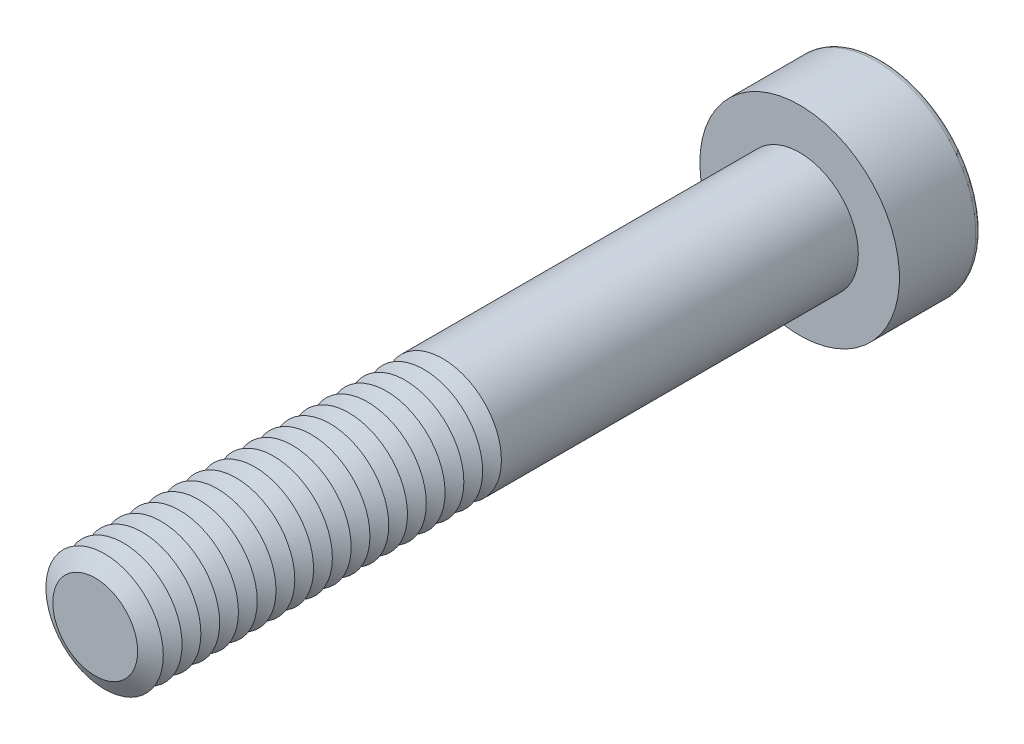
from build123d import *

# Parameters (mm, degrees)
SKETCH1_R           = 2.5
BOSS_EXTRUDE1_DEPTH = 30
SKETCH2_R           = 4.25
BOSS_EXTRUDE2_DEPTH = 3.5
CUT_EXTRUDE1_DEPTH  = 2.25
FILLET1_R           = 0.25
LPATTERN1_COUNT     = 19
LPATTERN1_PITCH     = 0.8


with BuildPart() as part:
    # Sketch1 → Boss-Extrude1 (new body)
    with BuildSketch(Plane.XY):
        Circle(SKETCH1_R)
    extrude(amount=BOSS_EXTRUDE1_DEPTH)

    # Sketch2 → Boss-Extrude2 (add)
    with BuildSketch(Plane(origin=(0, 0, 0), x_dir=(-1, 0, 0), z_dir=(0, 0, -1))):
        Circle(SKETCH2_R)
    extrude(amount=BOSS_EXTRUDE2_DEPTH)

    # Sketch3 → Cut-Extrude1 (cut)
    with BuildSketch(Plane(origin=(0, 0, -3.5), x_dir=(-1, 0, 0), z_dir=(0, 0, -1))):
        Polygon((-0.866025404, 1.5), (-1.732050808, 0), (-0.866025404, -1.5), (0.866025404, -1.5), (1.732050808, 0), (0.866025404, 1.5), align=None)
    extrude(amount=-CUT_EXTRUDE1_DEPTH, mode=Mode.SUBTRACT)

    # Fillet1
    fillet1_edges = [part.edges().sort_by_distance(p)[0] for p in [
        (4.25, 0, -3.5),
    ]]
    fillet(fillet1_edges, radius=FILLET1_R)

    # Cut-Extrude2 cone 1 section (on through the dimple's axis) → Cut-Extrude2 (revolve, cut)
    with BuildSketch(Plane(origin=(0, 0, -1.25), x_dir=(0, 1, 0), z_dir=(1, 0, 0))):
        Polygon((0, 0), (1.5, 0), (0, 0.866025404), align=None)
    revolve(axis=Axis((0, 0, -1.25), (0, 0, 1)), mode=Mode.SUBTRACT)

    # Cut-Extrude3 cone 1 section (on through the dimple's axis) → Cut-Extrude3 (revolve, cut)
    with BuildSketch(Plane(origin=(0, 0, -3.5), x_dir=(0, 1, 0), z_dir=(1, 0, 0))):
        Polygon((0, 0), (1.732050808, 0), (0, 0.464101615), align=None)
    revolve(axis=Axis((0, 0, -3.5), (0, 0, 1)), mode=Mode.SUBTRACT)

    # Sketch7 → Cut-Revolve1 (revolve, cut)
    with BuildSketch(Plane(origin=(0, 0, 0), x_dir=(0, 0, -1), z_dir=(1, 0, 0)), mode=Mode.PRIVATE) as cut_revolve1_sk:
        Polygon((-30, 1.807179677), (-29.6, 2.5), (-30.4, 2.5), align=None)
    cut_revolve1 = revolve(cut_revolve1_sk.sketch.rotate(Axis((0, 0, 30), (0, 0, -1)), 90), axis=Axis((0, 0, 30), (0, 0, -1)), mode=Mode.SUBTRACT)

    # LPattern1: Cut-Revolve1 ×19
    with Locations(*[(0, 0, -i * LPATTERN1_PITCH) for i in range(1, LPATTERN1_COUNT)]):
        add(cut_revolve1, mode=Mode.SUBTRACT)


solid = part.part
